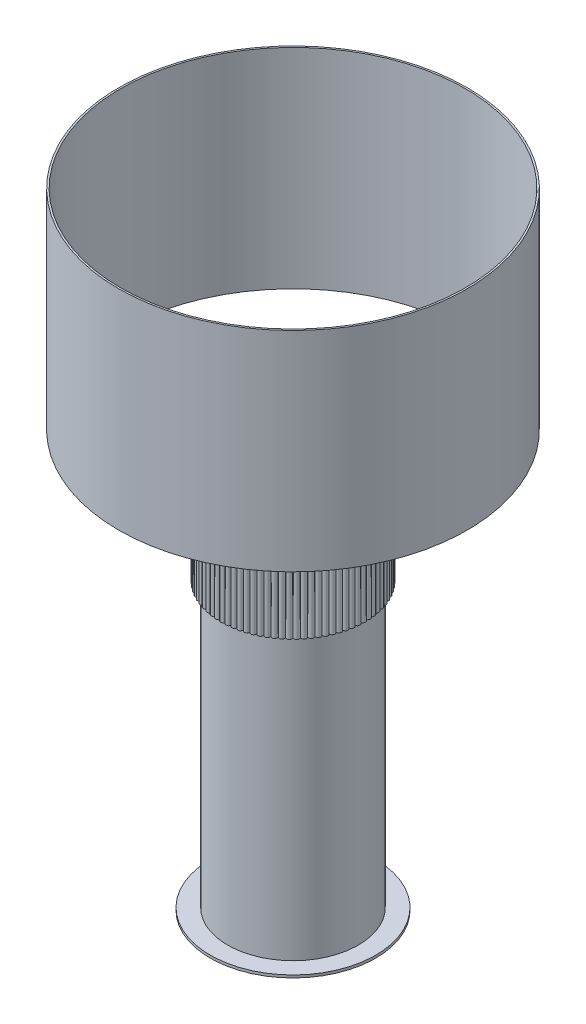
from build123d import *

# Parameters (mm, degrees)
SALIENTE_EXTRUIR1_DEPTH   = 100
CROQUIS2_R                = 75
CORTAR_EXTRUIR1_DEPTH     = 75
CROQUIS3_R                = 5
CORTAR_EXTRUIR2_DEPTH     = 75
CROQUIS4_R                = 75
CROQUIS4_R_2              = 70
SALIENTE_EXTRUIR2_DEPTH   = 400
CROQUIS5_R                = 6
SALIENTE_EXTRUIR3_DEPTH   = 50
CROQUIS6_R                = 95
SALIENTE_EXTRUIR4_DEPTH   = 3
CROQUIS7_R                = 5
SALIENTE_EXTRUIR5_DEPTH   = 5
SALIENTE_EXTRUIR5_2_DEPTH = 5
SALIENTE_EXTRUIR5_3_DEPTH = 5
REDONDEO1_R               = 1
REDONDEO2_R               = 1
REDONDEO3_R               = 1
CROQUIS8_R                = 200
CROQUIS8_R_2              = 198
SALIENTE_EXTRUIR6_DEPTH   = 240
CROQUIS9_R                = 20
SALIENTE_EXTRUIR7_DEPTH   = 2


with BuildPart() as part:
    # Croquis1 → Saliente-Extruir1 (new body)
    with BuildSketch(Plane(origin=(0, 0, 0), x_dir=(1, 0, 0), z_dir=(0, 1, 0))):
        with BuildLine():
            ThreePointArc((2.997742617, 80.116358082), (0, 83), (-2.997742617, 80.116358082))
            ThreePointArc((-2.997742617, 80.116358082), (-6.202597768, 82.767915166), (-8.976463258, 79.66831491))
            ThreePointArc((-8.976463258, 79.66831491), (-12.370508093, 82.072958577), (-14.904983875, 78.774734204))
            ThreePointArc((-14.904983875, 78.774734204), (-18.469237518, 80.919016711), (-20.750149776, 77.44061323))
            ThreePointArc((-20.750149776, 77.44061323), (-24.464679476, 79.31254288), (-26.479272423, 75.673412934))
            ThreePointArc((-26.479272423, 75.673412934), (-30.323305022, 77.262521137), (-32.060312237, 73.483016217))
            ThreePointArc((-32.060312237, 73.483016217), (-36.012350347, 74.780416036), (-37.462057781, 70.881672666))
            ThreePointArc((-37.462057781, 70.881672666), (-41.5, 71.880108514), (-42.654300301, 67.883930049))
            ThreePointArc((-42.654300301, 67.883930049), (-46.755564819, 68.577818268), (-47.608002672, 64.50655296))
            ThreePointArc((-47.608002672, 64.50655296), (-51.749653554, 64.892013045), (-52.29546178, 60.768429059))
            ThreePointArc((-52.29546178, 60.768429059), (-56.454337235, 60.843305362), (-56.690463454, 56.690463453))
            ThreePointArc((-56.690463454, 56.690463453), (-60.843305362, 56.454337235), (-60.768429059, 52.29546178))
            ThreePointArc((-60.768429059, 52.29546178), (-64.892013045, 51.749653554), (-64.50655296, 47.608002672))
            ThreePointArc((-64.50655296, 47.608002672), (-68.577818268, 46.755564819), (-67.883930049, 42.654300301))
            ThreePointArc((-67.883930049, 42.654300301), (-71.880108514, 41.5), (-70.881672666, 37.462057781))
            ThreePointArc((-70.881672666, 37.462057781), (-74.780416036, 36.012350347), (-73.483016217, 32.060312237))
            ThreePointArc((-73.483016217, 32.060312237), (-77.262521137, 30.323305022), (-75.673412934, 26.479272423))
            ThreePointArc((-75.673412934, 26.479272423), (-79.31254288, 24.464679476), (-77.44061323, 20.750149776))
            ThreePointArc((-77.44061323, 20.750149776), (-80.919016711, 18.469237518), (-78.774734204, 14.904983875))
            ThreePointArc((-78.774734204, 14.904983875), (-82.072958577, 12.370508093), (-79.66831491, 8.976463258))
            ThreePointArc((-79.66831491, 8.976463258), (-82.767915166, 6.202597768), (-80.116358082, 2.997742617))
            ThreePointArc((-80.116358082, 2.997742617), (-83, 0), (-80.116358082, -2.997742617))
            ThreePointArc((-80.116358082, -2.997742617), (-82.767915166, -6.202597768), (-79.66831491, -8.976463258))
            ThreePointArc((-79.66831491, -8.976463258), (-82.072958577, -12.370508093), (-78.774734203, -14.904983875))
            ThreePointArc((-78.774734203, -14.904983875), (-80.919016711, -18.469237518), (-77.44061323, -20.750149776))
            ThreePointArc((-77.44061323, -20.750149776), (-79.31254288, -24.464679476), (-75.673412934, -26.479272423))
            ThreePointArc((-75.673412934, -26.479272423), (-77.262521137, -30.323305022), (-73.483016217, -32.060312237))
            ThreePointArc((-73.483016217, -32.060312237), (-74.780416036, -36.012350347), (-70.881672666, -37.462057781))
            ThreePointArc((-70.881672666, -37.462057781), (-71.880108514, -41.5), (-67.883930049, -42.654300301))
            ThreePointArc((-67.883930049, -42.654300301), (-68.577818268, -46.755564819), (-64.506552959, -47.608002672))
            ThreePointArc((-64.506552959, -47.608002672), (-64.892013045, -51.749653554), (-60.768429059, -52.295461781))
            ThreePointArc((-60.768429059, -52.295461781), (-60.843305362, -56.454337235), (-56.690463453, -56.690463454))
            ThreePointArc((-56.690463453, -56.690463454), (-56.454337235, -60.843305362), (-52.29546178, -60.768429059))
            ThreePointArc((-52.29546178, -60.768429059), (-51.749653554, -64.892013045), (-47.608002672, -64.50655296))
            ThreePointArc((-47.608002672, -64.50655296), (-46.755564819, -68.577818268), (-42.654300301, -67.88393005))
            ThreePointArc((-42.654300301, -67.88393005), (-41.5, -71.880108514), (-37.462057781, -70.881672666))
            ThreePointArc((-37.462057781, -70.881672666), (-36.012350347, -74.780416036), (-32.060312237, -73.483016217))
            ThreePointArc((-32.060312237, -73.483016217), (-30.323305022, -77.262521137), (-26.479272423, -75.673412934))
            ThreePointArc((-26.479272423, -75.673412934), (-24.464679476, -79.31254288), (-20.750149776, -77.44061323))
            ThreePointArc((-20.750149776, -77.44061323), (-18.469237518, -80.919016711), (-14.904983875, -78.774734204))
            ThreePointArc((-14.904983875, -78.774734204), (-12.370508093, -82.072958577), (-8.976463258, -79.66831491))
            ThreePointArc((-8.976463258, -79.66831491), (-6.202597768, -82.767915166), (-2.997742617, -80.116358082))
            ThreePointArc((-2.997742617, -80.116358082), (0, -83), (2.997742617, -80.116358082))
            ThreePointArc((2.997742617, -80.116358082), (6.202597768, -82.767915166), (8.976463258, -79.66831491))
            ThreePointArc((8.976463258, -79.66831491), (12.370508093, -82.072958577), (14.904983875, -78.774734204))
            ThreePointArc((14.904983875, -78.774734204), (18.469237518, -80.919016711), (20.750149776, -77.44061323))
            ThreePointArc((20.750149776, -77.44061323), (24.464679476, -79.31254288), (26.479272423, -75.673412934))
            ThreePointArc((26.479272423, -75.673412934), (30.323305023, -77.262521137), (32.060312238, -73.483016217))
            ThreePointArc((32.060312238, -73.483016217), (36.012350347, -74.780416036), (37.462057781, -70.881672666))
            ThreePointArc((37.462057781, -70.881672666), (41.5, -71.880108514), (42.654300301, -67.883930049))
            ThreePointArc((42.654300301, -67.883930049), (46.755564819, -68.577818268), (47.608002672, -64.50655296))
            ThreePointArc((47.608002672, -64.50655296), (51.749653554, -64.892013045), (52.295461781, -60.768429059))
            ThreePointArc((52.295461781, -60.768429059), (56.454337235, -60.843305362), (56.690463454, -56.690463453))
            ThreePointArc((56.690463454, -56.690463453), (60.843305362, -56.454337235), (60.768429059, -52.29546178))
            ThreePointArc((60.768429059, -52.29546178), (64.892013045, -51.749653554), (64.50655296, -47.608002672))
            ThreePointArc((64.50655296, -47.608002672), (68.577818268, -46.755564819), (67.88393005, -42.654300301))
            ThreePointArc((67.88393005, -42.654300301), (71.880108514, -41.5), (70.881672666, -37.462057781))
            ThreePointArc((70.881672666, -37.462057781), (74.780416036, -36.012350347), (73.483016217, -32.060312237))
            ThreePointArc((73.483016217, -32.060312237), (77.262521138, -30.323305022), (75.673412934, -26.479272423))
            ThreePointArc((75.673412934, -26.479272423), (79.31254288, -24.464679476), (77.44061323, -20.750149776))
            ThreePointArc((77.44061323, -20.750149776), (80.919016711, -18.469237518), (78.774734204, -14.904983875))
            ThreePointArc((78.774734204, -14.904983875), (82.072958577, -12.370508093), (79.66831491, -8.976463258))
            ThreePointArc((79.66831491, -8.976463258), (82.767915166, -6.202597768), (80.116358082, -2.997742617))
            ThreePointArc((80.116358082, -2.997742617), (83, 0), (80.116358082, 2.997742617))
            ThreePointArc((80.116358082, 2.997742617), (82.767915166, 6.202597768), (79.66831491, 8.976463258))
            ThreePointArc((79.66831491, 8.976463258), (82.072958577, 12.370508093), (78.774734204, 14.904983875))
            ThreePointArc((78.774734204, 14.904983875), (80.919016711, 18.469237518), (77.44061323, 20.750149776))
            ThreePointArc((77.44061323, 20.750149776), (79.31254288, 24.464679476), (75.673412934, 26.479272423))
            ThreePointArc((75.673412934, 26.479272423), (77.262521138, 30.323305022), (73.483016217, 32.060312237))
            ThreePointArc((73.483016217, 32.060312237), (74.780416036, 36.012350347), (70.881672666, 37.462057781))
            ThreePointArc((70.881672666, 37.462057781), (71.880108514, 41.5), (67.883930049, 42.654300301))
            ThreePointArc((67.883930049, 42.654300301), (68.577818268, 46.755564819), (64.50655296, 47.608002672))
            ThreePointArc((64.50655296, 47.608002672), (64.892013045, 51.749653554), (60.768429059, 52.295461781))
            ThreePointArc((60.768429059, 52.295461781), (60.843305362, 56.454337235), (56.690463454, 56.690463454))
            ThreePointArc((56.690463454, 56.690463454), (56.454337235, 60.843305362), (52.29546178, 60.768429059))
            ThreePointArc((52.29546178, 60.768429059), (51.749653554, 64.892013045), (47.608002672, 64.50655296))
            ThreePointArc((47.608002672, 64.50655296), (46.755564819, 68.577818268), (42.654300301, 67.88393005))
            ThreePointArc((42.654300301, 67.88393005), (41.5, 71.880108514), (37.462057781, 70.881672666))
            ThreePointArc((37.462057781, 70.881672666), (36.012350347, 74.780416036), (32.060312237, 73.483016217))
            ThreePointArc((32.060312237, 73.483016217), (30.323305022, 77.262521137), (26.479272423, 75.673412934))
            ThreePointArc((26.479272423, 75.673412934), (24.464679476, 79.31254288), (20.750149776, 77.44061323))
            ThreePointArc((20.750149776, 77.44061323), (18.469237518, 80.919016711), (14.904983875, 78.774734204))
            ThreePointArc((14.904983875, 78.774734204), (12.370508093, 82.072958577), (8.976463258, 79.66831491))
            ThreePointArc((8.976463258, 79.66831491), (6.202597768, 82.767915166), (2.997742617, 80.116358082))
        make_face()
    extrude(amount=SALIENTE_EXTRUIR1_DEPTH)

    # Croquis2 → Cortar-Extruir1 (cut)
    with BuildSketch(Plane.XZ):
        with Locations(Location((0, 0, 0), (0, 0, 270))):
            Circle(CROQUIS2_R)
    extrude(amount=-CORTAR_EXTRUIR1_DEPTH, mode=Mode.SUBTRACT)

    # Croquis3 → Cortar-Extruir2 (cut)
    with BuildSketch(Plane(origin=(0, 100, 0), x_dir=(1, 0, 0), z_dir=(0, 1, 0))):
        with Locations(Location((0, 0, 0), (0, 0, 270))):
            Circle(CROQUIS3_R)
    extrude(amount=-CORTAR_EXTRUIR2_DEPTH, mode=Mode.SUBTRACT)


with BuildPart() as body_2:
    # Croquis4 → Saliente-Extruir2 (new body)
    with BuildSketch(Plane.XZ.offset(-75)):
        with Locations(Location((0, 0, 0), (0, 0, 270))):
            Circle(CROQUIS4_R)
        with Locations(Location((0, 0, 0), (0, 0, 270))):
            Circle(CROQUIS4_R_2, mode=Mode.SUBTRACT)
    extrude(amount=SALIENTE_EXTRUIR2_DEPTH)


with BuildPart() as body_3:
    # Croquis5 → Saliente-Extruir3 (new body)
    with BuildSketch(Plane(origin=(0, 100, 0), x_dir=(1, 0, 0), z_dir=(0, 1, 0))):
        with Locations(Location((0, 0, 0), (0, 0, 270))):
            Circle(CROQUIS5_R)
    extrude(amount=SALIENTE_EXTRUIR3_DEPTH)


with BuildPart() as body_4:
    # Croquis6 → Saliente-Extruir4 (new body)
    with BuildSketch(Plane.XZ.offset(325)):
        with Locations(Location((0, 0, 0), (0, 0, 270))):
            Circle(CROQUIS6_R)
    extrude(amount=SALIENTE_EXTRUIR4_DEPTH)


with BuildPart() as body_5:
    # Croquis7 → Saliente-Extruir5 (new body)
    with BuildSketch(Plane.XZ.offset(328)):
        with Locations(Location((60.621778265, -35, 0), (0, 0, 270))):
            Circle(CROQUIS7_R)
    extrude(amount=SALIENTE_EXTRUIR5_DEPTH)

    # Redondeo1
    redondeo1_edges = [body_5.edges().sort_by_distance(p)[0] for p in [
        (60.621778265, -333, -30),
    ]]
    fillet(redondeo1_edges, radius=REDONDEO1_R)


with BuildPart() as body_6:
    # Croquis7 → Saliente-Extruir5 2 (new body)
    with BuildSketch(Plane.XZ.offset(328)):
        with Locations(Location((0, 70, 0), (0, 0, 270))):
            Circle(CROQUIS7_R)
    extrude(amount=SALIENTE_EXTRUIR5_2_DEPTH)

    # Redondeo2
    redondeo2_edges = [body_6.edges().sort_by_distance(p)[0] for p in [
        (0, -333, 75),
    ]]
    fillet(redondeo2_edges, radius=REDONDEO2_R)


with BuildPart() as body_7:
    # Croquis7 → Saliente-Extruir5 3 (new body)
    with BuildSketch(Plane.XZ.offset(328)):
        with Locations(Location((-60.621778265, -35, 0), (0, 0, 270))):
            Circle(CROQUIS7_R)
    extrude(amount=SALIENTE_EXTRUIR5_3_DEPTH)

    # Redondeo3
    redondeo3_edges = [body_7.edges().sort_by_distance(p)[0] for p in [
        (-60.621778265, -333, -30),
    ]]
    fillet(redondeo3_edges, radius=REDONDEO3_R)


with BuildPart() as body_8:
    # Croquis8 → Saliente-Extruir6 (new body)
    with BuildSketch(Plane(origin=(0, 150, 0), x_dir=(1, 0, 0), z_dir=(0, 1, 0))):
        with Locations(Location((0, 0, 0), (0, 0, 270))):
            Circle(CROQUIS8_R)
        with Locations(Location((0, 0, 0), (0, 0, 270))):
            Circle(CROQUIS8_R_2, mode=Mode.SUBTRACT)
    extrude(amount=SALIENTE_EXTRUIR6_DEPTH)


with BuildPart() as body_9:
    # Croquis9 → Saliente-Extruir7 (new body)
    with BuildSketch(Plane(origin=(0, 100, 0), x_dir=(1, 0, 0), z_dir=(0, 1, 0))):
        with Locations(Location((0, 0, 0), (0, 0, 270))):
            Circle(CROQUIS9_R)
    extrude(amount=SALIENTE_EXTRUIR7_DEPTH)


solid = Compound([part.part, body_2.part, body_3.part, body_4.part, body_5.part, body_6.part, body_7.part, body_8.part, body_9.part])
